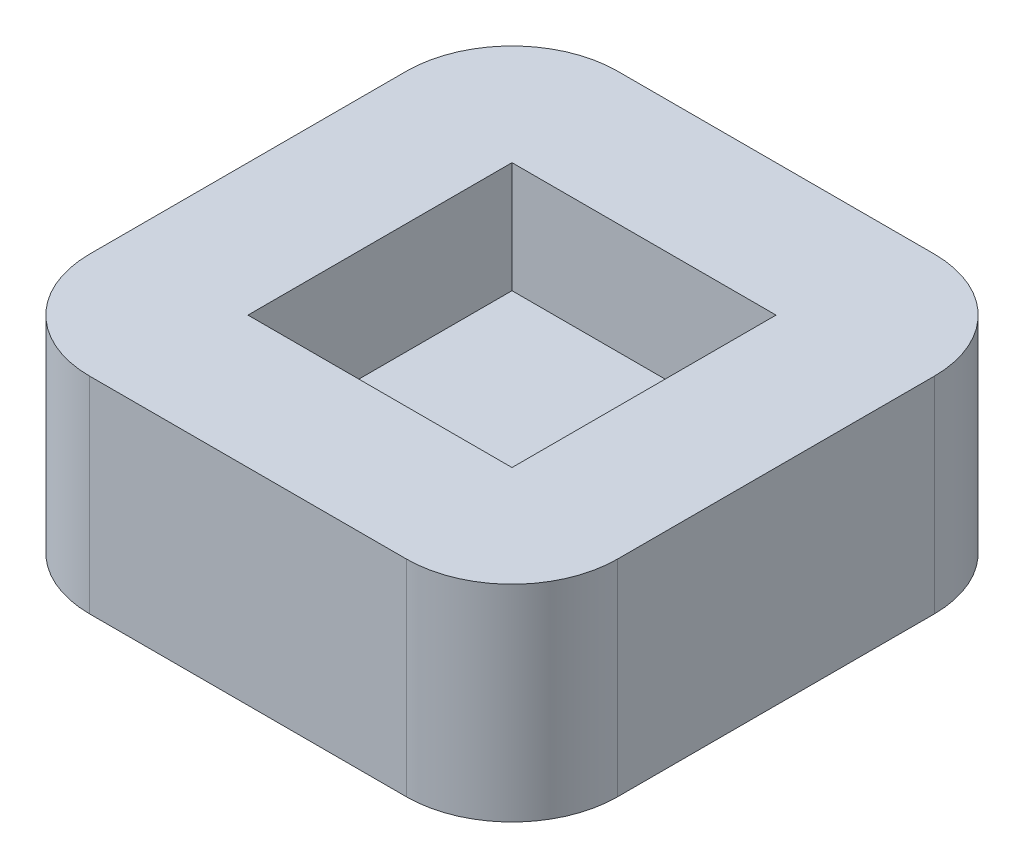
from build123d import *

# Parameters (mm, degrees)
EXTRUDE1_DEPTH     = 39
SKETCH2_W          = 50
SKETCH2_H          = 50
CUT_EXTRUDE1_DEPTH = 21


with BuildPart() as part:
    # Sketch1 → Extrude1 (new body)
    with BuildSketch(Plane(origin=(0, 0, 0), x_dir=(1, 0, 0), z_dir=(0, 1, 0))):
        with BuildLine():
            Line((-30, 50), (30, 50))
            ThreePointArc((30, 50), (44.142135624, 44.142135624), (50, 30))
            Line((50, 30), (50, -30))
            ThreePointArc((50, -30), (44.142135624, -44.142135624), (30, -50))
            Line((30, -50), (-30, -50))
            ThreePointArc((-30, -50), (-44.142135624, -44.142135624), (-50, -30))
            Line((-50, -30), (-50, 30))
            ThreePointArc((-50, 30), (-44.142135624, 44.142135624), (-30, 50))
        make_face()
    extrude(amount=EXTRUDE1_DEPTH)

    # Sketch2 → Cut-Extrude1 (cut)
    with BuildSketch(Plane(origin=(0, 39, 0), x_dir=(-1, 0, 0), z_dir=(0, 1, 0))):
        Rectangle(SKETCH2_W, SKETCH2_H)
    extrude(amount=-CUT_EXTRUDE1_DEPTH, mode=Mode.SUBTRACT)


solid = part.part
